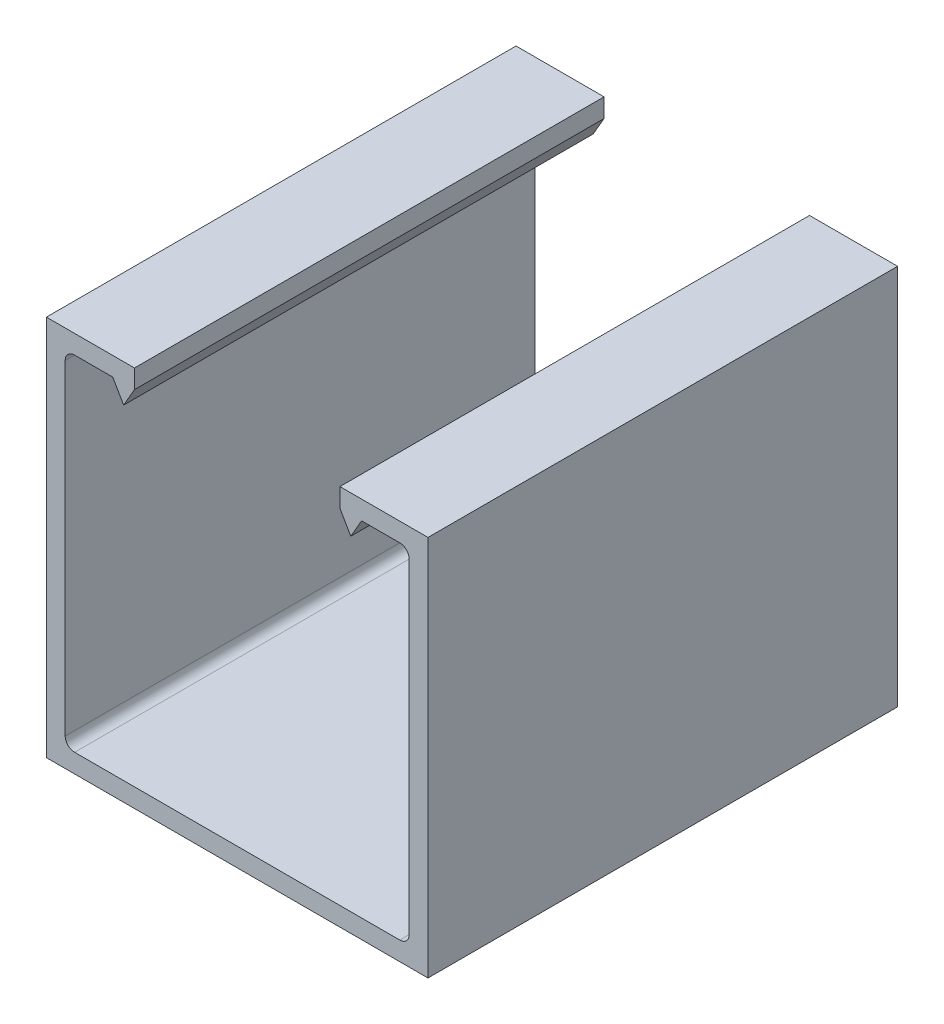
ISO-10303-21;
HEADER;
FILE_DESCRIPTION(('STEP AP214'),'2;1');
FILE_NAME('part.step','',(''),(''),'','','');
FILE_SCHEMA(('AUTOMOTIVE_DESIGN { 1 0 10303 214 1 1 1 1 }'));
ENDSEC;
DATA;
#1=APPLICATION_CONTEXT('core data for automotive mechanical design processes');
#2=APPLICATION_PROTOCOL_DEFINITION('international standard','automotive_design',2000,#1);
#3=PRODUCT_CONTEXT('',#1,'mechanical');
#4=PRODUCT('Part','Part','',(#3));
#5=PRODUCT_RELATED_PRODUCT_CATEGORY('part','',(#4));
#6=PRODUCT_DEFINITION_FORMATION('','',#4);
#7=PRODUCT_DEFINITION_CONTEXT('part definition',#1,'design');
#8=PRODUCT_DEFINITION('design','',#6,#7);
#9=PRODUCT_DEFINITION_SHAPE('','',#8);
#10=(LENGTH_UNIT() NAMED_UNIT(*) SI_UNIT(.MILLI.,.METRE.));
#11=(NAMED_UNIT(*) PLANE_ANGLE_UNIT() SI_UNIT($,.RADIAN.));
#12=(NAMED_UNIT(*) SI_UNIT($,.STERADIAN.) SOLID_ANGLE_UNIT());
#13=UNCERTAINTY_MEASURE_WITH_UNIT(LENGTH_MEASURE(1.E-05),#10,'distance_accuracy_value','');
#14=(GEOMETRIC_REPRESENTATION_CONTEXT(3) GLOBAL_UNCERTAINTY_ASSIGNED_CONTEXT((#13)) GLOBAL_UNIT_ASSIGNED_CONTEXT((#10,
#11,#12)) REPRESENTATION_CONTEXT('',''));
#15=CARTESIAN_POINT('',(0.,0.,0.));
#16=DIRECTION('',(0.,0.,1.));
#17=DIRECTION('',(1.,0.,0.));
#18=AXIS2_PLACEMENT_3D('',#15,#16,#17);
#19=CARTESIAN_POINT('',(-8.79475,-8.79475,12.7));
#20=DIRECTION('',(0.,0.,-1.));
#21=DIRECTION('',(-1.,0.,0.));
#22=AXIS2_PLACEMENT_3D('',#19,#20,#21);
#23=CYLINDRICAL_SURFACE('',#22,0.508);
#24=CARTESIAN_POINT('',(-8.79475,-8.79475,-12.7));
#25=DIRECTION('',(0.,0.,-1.));
#26=DIRECTION('',(1.,0.,0.));
#27=AXIS2_PLACEMENT_3D('',#24,#25,#26);
#28=CIRCLE('',#27,0.508);
#29=CARTESIAN_POINT('',(-8.79475,-9.30275,-12.7));
#30=VERTEX_POINT('',#29);
#31=CARTESIAN_POINT('',(-9.30275,-8.79475,-12.7));
#32=VERTEX_POINT('',#31);
#33=EDGE_CURVE('E207',#30,#32,#28,.T.);
#34=ORIENTED_EDGE('',*,*,#33,.T.);
#35=DIRECTION('',(0.,0.,-1.));
#36=VECTOR('',#35,1.);
#37=CARTESIAN_POINT('',(-9.30275,-8.79475,12.7));
#38=LINE('',#37,#36);
#39=CARTESIAN_POINT('',(-9.30275,-8.79475,12.7));
#40=VERTEX_POINT('',#39);
#41=EDGE_CURVE('E11',#40,#32,#38,.T.);
#42=ORIENTED_EDGE('',*,*,#41,.F.);
#43=CARTESIAN_POINT('',(-8.79475,-8.79475,12.7));
#44=DIRECTION('',(0.,0.,-1.));
#45=DIRECTION('',(1.,0.,0.));
#46=AXIS2_PLACEMENT_3D('',#43,#44,#45);
#47=CIRCLE('',#46,0.508);
#48=CARTESIAN_POINT('',(-8.79475,-9.30275,12.7));
#49=VERTEX_POINT('',#48);
#50=EDGE_CURVE('E245',#49,#40,#47,.T.);
#51=ORIENTED_EDGE('',*,*,#50,.F.);
#52=DIRECTION('',(0.,0.,-1.));
#53=VECTOR('',#52,1.);
#54=CARTESIAN_POINT('',(-8.79475,-9.30275,12.7));
#55=LINE('',#54,#53);
#56=EDGE_CURVE('E203',#49,#30,#55,.T.);
#57=ORIENTED_EDGE('',*,*,#56,.T.);
#58=EDGE_LOOP('',(#34,#42,#51,#57));
#59=FACE_BOUND('',#58,.T.);
#60=ADVANCED_FACE('F39',(#59),#23,.F.);
#61=CARTESIAN_POINT('',(-9.30275,8.79475,12.7));
#62=DIRECTION('',(-1.,0.,0.));
#63=DIRECTION('',(0.,-1.,0.));
#64=AXIS2_PLACEMENT_3D('',#61,#62,#63);
#65=PLANE('',#64);
#66=DIRECTION('',(0.,1.,0.));
#67=VECTOR('',#66,1.);
#68=CARTESIAN_POINT('',(-9.30275,8.79475,-12.7));
#69=LINE('',#68,#67);
#70=CARTESIAN_POINT('',(-9.30275,8.79475,-12.7));
#71=VERTEX_POINT('',#70);
#72=EDGE_CURVE('E210',#32,#71,#69,.T.);
#73=ORIENTED_EDGE('',*,*,#72,.T.);
#74=DIRECTION('',(0.,0.,-1.));
#75=VECTOR('',#74,1.);
#76=CARTESIAN_POINT('',(-9.30275,8.79475,12.7));
#77=LINE('',#76,#75);
#78=CARTESIAN_POINT('',(-9.30275,8.79475,12.7));
#79=VERTEX_POINT('',#78);
#80=EDGE_CURVE('E47',#79,#71,#77,.T.);
#81=ORIENTED_EDGE('',*,*,#80,.F.);
#82=DIRECTION('',(0.,1.,0.));
#83=VECTOR('',#82,1.);
#84=CARTESIAN_POINT('',(-9.30275,8.79475,12.7));
#85=LINE('',#84,#83);
#86=EDGE_CURVE('E134',#40,#79,#85,.T.);
#87=ORIENTED_EDGE('',*,*,#86,.F.);
#88=ORIENTED_EDGE('',*,*,#41,.T.);
#89=EDGE_LOOP('',(#73,#81,#87,#88));
#90=FACE_BOUND('',#89,.T.);
#91=ADVANCED_FACE('F363',(#90),#65,.F.);
#92=CARTESIAN_POINT('',(-8.79475,8.79475,12.7));
#93=DIRECTION('',(0.,0.,-1.));
#94=DIRECTION('',(-1.,0.,0.));
#95=AXIS2_PLACEMENT_3D('',#92,#93,#94);
#96=CYLINDRICAL_SURFACE('',#95,0.508000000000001);
#97=CARTESIAN_POINT('',(-8.79475,8.79475,-12.7));
#98=DIRECTION('',(0.,0.,-1.));
#99=DIRECTION('',(1.,0.,0.));
#100=AXIS2_PLACEMENT_3D('',#97,#98,#99);
#101=CIRCLE('',#100,0.508000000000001);
#102=CARTESIAN_POINT('',(-8.79475,9.30275,-12.7));
#103=VERTEX_POINT('',#102);
#104=EDGE_CURVE('E212',#71,#103,#101,.T.);
#105=ORIENTED_EDGE('',*,*,#104,.T.);
#106=DIRECTION('',(0.,0.,-1.));
#107=VECTOR('',#106,1.);
#108=CARTESIAN_POINT('',(-8.79475,9.30275,12.7));
#109=LINE('',#108,#107);
#110=CARTESIAN_POINT('',(-8.79475,9.30275,12.7));
#111=VERTEX_POINT('',#110);
#112=EDGE_CURVE('E288',#111,#103,#109,.T.);
#113=ORIENTED_EDGE('',*,*,#112,.F.);
#114=CARTESIAN_POINT('',(-8.79475,8.79475,12.7));
#115=DIRECTION('',(0.,0.,-1.));
#116=DIRECTION('',(1.,0.,0.));
#117=AXIS2_PLACEMENT_3D('',#114,#115,#116);
#118=CIRCLE('',#117,0.508000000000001);
#119=EDGE_CURVE('E296',#79,#111,#118,.T.);
#120=ORIENTED_EDGE('',*,*,#119,.F.);
#121=ORIENTED_EDGE('',*,*,#80,.T.);
#122=EDGE_LOOP('',(#105,#113,#120,#121));
#123=FACE_BOUND('',#122,.T.);
#124=ADVANCED_FACE('F294',(#123),#96,.F.);
#125=CARTESIAN_POINT('',(-6.72942574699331,9.30275,12.7));
#126=DIRECTION('',(0.,1.,0.));
#127=DIRECTION('',(-1.,0.,0.));
#128=AXIS2_PLACEMENT_3D('',#125,#126,#127);
#129=PLANE('',#128);
#130=DIRECTION('',(1.,0.,0.));
#131=VECTOR('',#130,1.);
#132=CARTESIAN_POINT('',(-6.72942574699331,9.30275,-12.7));
#133=LINE('',#132,#131);
#134=CARTESIAN_POINT('',(-6.72942574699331,9.30275,-12.7));
#135=VERTEX_POINT('',#134);
#136=EDGE_CURVE('E214',#103,#135,#133,.T.);
#137=ORIENTED_EDGE('',*,*,#136,.T.);
#138=DIRECTION('',(0.,0.,-1.));
#139=VECTOR('',#138,1.);
#140=CARTESIAN_POINT('',(-6.72942574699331,9.30275,12.7));
#141=LINE('',#140,#139);
#142=CARTESIAN_POINT('',(-6.72942574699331,9.30275,12.7));
#143=VERTEX_POINT('',#142);
#144=EDGE_CURVE('E285',#143,#135,#141,.T.);
#145=ORIENTED_EDGE('',*,*,#144,.F.);
#146=DIRECTION('',(1.,0.,0.));
#147=VECTOR('',#146,1.);
#148=CARTESIAN_POINT('',(-6.72942574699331,9.30275,12.7));
#149=LINE('',#148,#147);
#150=EDGE_CURVE('E314',#111,#143,#149,.T.);
#151=ORIENTED_EDGE('',*,*,#150,.F.);
#152=ORIENTED_EDGE('',*,*,#112,.T.);
#153=EDGE_LOOP('',(#137,#145,#151,#152));
#154=FACE_BOUND('',#153,.T.);
#155=ADVANCED_FACE('F305',(#154),#129,.F.);
#156=CARTESIAN_POINT('',(-6.72942574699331,9.30275,12.7));
#157=DIRECTION('',(0.866025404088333,0.49999999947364,0.));
#158=DIRECTION('',(-0.49999999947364,0.866025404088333,0.));
#159=AXIS2_PLACEMENT_3D('',#156,#157,#158);
#160=PLANE('',#159);
#161=DIRECTION('',(0.49999999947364,-0.866025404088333,0.));
#162=VECTOR('',#161,1.);
#163=CARTESIAN_POINT('',(-6.72942574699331,9.30275,-12.7));
#164=LINE('',#163,#162);
#165=CARTESIAN_POINT('',(-6.14283787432,8.28675,-12.7));
#166=VERTEX_POINT('',#165);
#167=EDGE_CURVE('E216',#135,#166,#164,.T.);
#168=ORIENTED_EDGE('',*,*,#167,.T.);
#169=DIRECTION('',(0.,0.,-1.));
#170=VECTOR('',#169,1.);
#171=CARTESIAN_POINT('',(-6.14283787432,8.28675,12.7));
#172=LINE('',#171,#170);
#173=CARTESIAN_POINT('',(-6.14283787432,8.28675,12.7));
#174=VERTEX_POINT('',#173);
#175=EDGE_CURVE('E282',#174,#166,#172,.T.);
#176=ORIENTED_EDGE('',*,*,#175,.F.);
#177=DIRECTION('',(0.49999999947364,-0.866025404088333,0.));
#178=VECTOR('',#177,1.);
#179=CARTESIAN_POINT('',(-6.72942574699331,9.30275,12.7));
#180=LINE('',#179,#178);
#181=EDGE_CURVE('E311',#143,#174,#180,.T.);
#182=ORIENTED_EDGE('',*,*,#181,.F.);
#183=ORIENTED_EDGE('',*,*,#144,.T.);
#184=EDGE_LOOP('',(#168,#176,#182,#183));
#185=FACE_BOUND('',#184,.T.);
#186=ADVANCED_FACE('F309',(#185),#160,.F.);
#187=CARTESIAN_POINT('',(-6.14283787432,8.28675,12.7));
#188=DIRECTION('',(-0.866025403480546,0.500000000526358,0.));
#189=DIRECTION('',(-0.500000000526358,-0.866025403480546,0.));
#190=AXIS2_PLACEMENT_3D('',#187,#188,#189);
#191=PLANE('',#190);
#192=DIRECTION('',(0.500000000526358,0.866025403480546,0.));
#193=VECTOR('',#192,1.);
#194=CARTESIAN_POINT('',(-6.14283787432,8.28675,-12.7));
#195=LINE('',#194,#193);
#196=CARTESIAN_POINT('',(-5.55625,9.30275,-12.7));
#197=VERTEX_POINT('',#196);
#198=EDGE_CURVE('E218',#166,#197,#195,.T.);
#199=ORIENTED_EDGE('',*,*,#198,.T.);
#200=DIRECTION('',(0.,0.,-1.));
#201=VECTOR('',#200,1.);
#202=CARTESIAN_POINT('',(-5.55625,9.30275,12.7));
#203=LINE('',#202,#201);
#204=CARTESIAN_POINT('',(-5.55625,9.30275,12.7));
#205=VERTEX_POINT('',#204);
#206=EDGE_CURVE('E279',#205,#197,#203,.T.);
#207=ORIENTED_EDGE('',*,*,#206,.F.);
#208=DIRECTION('',(0.500000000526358,0.866025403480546,0.));
#209=VECTOR('',#208,1.);
#210=CARTESIAN_POINT('',(-6.14283787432,8.28675,12.7));
#211=LINE('',#210,#209);
#212=EDGE_CURVE('E313',#174,#205,#211,.T.);
#213=ORIENTED_EDGE('',*,*,#212,.F.);
#214=ORIENTED_EDGE('',*,*,#175,.T.);
#215=EDGE_LOOP('',(#199,#207,#213,#214));
#216=FACE_BOUND('',#215,.T.);
#217=ADVANCED_FACE('F376',(#216),#191,.F.);
#218=CARTESIAN_POINT('',(-5.55625,9.30275,12.7));
#219=DIRECTION('',(-1.,0.,0.));
#220=DIRECTION('',(0.,0.,1.));
#221=AXIS2_PLACEMENT_3D('',#218,#219,#220);
#222=PLANE('',#221);
#223=DIRECTION('',(0.,1.,0.));
#224=VECTOR('',#223,1.);
#225=CARTESIAN_POINT('',(-5.55625,9.30275,-12.7));
#226=LINE('',#225,#224);
#227=CARTESIAN_POINT('',(-5.55625,10.31875,-12.7));
#228=VERTEX_POINT('',#227);
#229=EDGE_CURVE('E220',#197,#228,#226,.T.);
#230=ORIENTED_EDGE('',*,*,#229,.T.);
#231=DIRECTION('',(0.,0.,-1.));
#232=VECTOR('',#231,1.);
#233=CARTESIAN_POINT('',(-5.55625,10.31875,12.7));
#234=LINE('',#233,#232);
#235=CARTESIAN_POINT('',(-5.55625,10.31875,12.7));
#236=VERTEX_POINT('',#235);
#237=EDGE_CURVE('E276',#236,#228,#234,.T.);
#238=ORIENTED_EDGE('',*,*,#237,.F.);
#239=DIRECTION('',(0.,1.,0.));
#240=VECTOR('',#239,1.);
#241=CARTESIAN_POINT('',(-5.55625,9.30275,12.7));
#242=LINE('',#241,#240);
#243=EDGE_CURVE('E316',#205,#236,#242,.T.);
#244=ORIENTED_EDGE('',*,*,#243,.F.);
#245=ORIENTED_EDGE('',*,*,#206,.T.);
#246=EDGE_LOOP('',(#230,#238,#244,#245));
#247=FACE_BOUND('',#246,.T.);
#248=ADVANCED_FACE('F379',(#247),#222,.F.);
#249=CARTESIAN_POINT('',(-5.55625,10.31875,12.7));
#250=DIRECTION('',(0.,-1.,0.));
#251=DIRECTION('',(1.,0.,0.));
#252=AXIS2_PLACEMENT_3D('',#249,#250,#251);
#253=PLANE('',#252);
#254=DIRECTION('',(-1.,0.,0.));
#255=VECTOR('',#254,1.);
#256=CARTESIAN_POINT('',(-5.55625,10.31875,-12.7));
#257=LINE('',#256,#255);
#258=CARTESIAN_POINT('',(-10.31875,10.31875,-12.7));
#259=VERTEX_POINT('',#258);
#260=EDGE_CURVE('E222',#228,#259,#257,.T.);
#261=ORIENTED_EDGE('',*,*,#260,.T.);
#262=DIRECTION('',(0.,0.,-1.));
#263=VECTOR('',#262,1.);
#264=CARTESIAN_POINT('',(-10.31875,10.31875,12.7));
#265=LINE('',#264,#263);
#266=CARTESIAN_POINT('',(-10.31875,10.31875,12.7));
#267=VERTEX_POINT('',#266);
#268=EDGE_CURVE('E273',#267,#259,#265,.T.);
#269=ORIENTED_EDGE('',*,*,#268,.F.);
#270=DIRECTION('',(-1.,0.,0.));
#271=VECTOR('',#270,1.);
#272=CARTESIAN_POINT('',(-5.55625,10.31875,12.7));
#273=LINE('',#272,#271);
#274=EDGE_CURVE('E322',#236,#267,#273,.T.);
#275=ORIENTED_EDGE('',*,*,#274,.F.);
#276=ORIENTED_EDGE('',*,*,#237,.T.);
#277=EDGE_LOOP('',(#261,#269,#275,#276));
#278=FACE_BOUND('',#277,.T.);
#279=ADVANCED_FACE('F383',(#278),#253,.F.);
#280=CARTESIAN_POINT('',(-10.31875,10.31875,12.7));
#281=DIRECTION('',(1.,0.,0.));
#282=DIRECTION('',(0.,1.,0.));
#283=AXIS2_PLACEMENT_3D('',#280,#281,#282);
#284=PLANE('',#283);
#285=DIRECTION('',(0.,-1.,0.));
#286=VECTOR('',#285,1.);
#287=CARTESIAN_POINT('',(-10.31875,10.31875,-12.7));
#288=LINE('',#287,#286);
#289=CARTESIAN_POINT('',(-10.31875,-10.31875,-12.7));
#290=VERTEX_POINT('',#289);
#291=EDGE_CURVE('E224',#259,#290,#288,.T.);
#292=ORIENTED_EDGE('',*,*,#291,.T.);
#293=DIRECTION('',(0.,0.,-1.));
#294=VECTOR('',#293,1.);
#295=CARTESIAN_POINT('',(-10.31875,-10.31875,12.7));
#296=LINE('',#295,#294);
#297=CARTESIAN_POINT('',(-10.31875,-10.31875,12.7));
#298=VERTEX_POINT('',#297);
#299=EDGE_CURVE('E270',#298,#290,#296,.T.);
#300=ORIENTED_EDGE('',*,*,#299,.F.);
#301=DIRECTION('',(0.,-1.,0.));
#302=VECTOR('',#301,1.);
#303=CARTESIAN_POINT('',(-10.31875,10.31875,12.7));
#304=LINE('',#303,#302);
#305=EDGE_CURVE('E324',#267,#298,#304,.T.);
#306=ORIENTED_EDGE('',*,*,#305,.F.);
#307=ORIENTED_EDGE('',*,*,#268,.T.);
#308=EDGE_LOOP('',(#292,#300,#306,#307));
#309=FACE_BOUND('',#308,.T.);
#310=ADVANCED_FACE('F387',(#309),#284,.F.);
#311=CARTESIAN_POINT('',(-10.31875,-10.31875,12.7));
#312=DIRECTION('',(0.,1.,0.));
#313=DIRECTION('',(0.,0.,1.));
#314=AXIS2_PLACEMENT_3D('',#311,#312,#313);
#315=PLANE('',#314);
#316=DIRECTION('',(1.,0.,0.));
#317=VECTOR('',#316,1.);
#318=CARTESIAN_POINT('',(-10.31875,-10.31875,-12.7));
#319=LINE('',#318,#317);
#320=CARTESIAN_POINT('',(10.31875,-10.31875,-12.7));
#321=VERTEX_POINT('',#320);
#322=EDGE_CURVE('E226',#290,#321,#319,.T.);
#323=ORIENTED_EDGE('',*,*,#322,.T.);
#324=DIRECTION('',(0.,0.,-1.));
#325=VECTOR('',#324,1.);
#326=CARTESIAN_POINT('',(10.31875,-10.31875,12.7));
#327=LINE('',#326,#325);
#328=CARTESIAN_POINT('',(10.31875,-10.31875,12.7));
#329=VERTEX_POINT('',#328);
#330=EDGE_CURVE('E267',#329,#321,#327,.T.);
#331=ORIENTED_EDGE('',*,*,#330,.F.);
#332=DIRECTION('',(1.,0.,0.));
#333=VECTOR('',#332,1.);
#334=CARTESIAN_POINT('',(-10.31875,-10.31875,12.7));
#335=LINE('',#334,#333);
#336=EDGE_CURVE('E326',#298,#329,#335,.T.);
#337=ORIENTED_EDGE('',*,*,#336,.F.);
#338=ORIENTED_EDGE('',*,*,#299,.T.);
#339=EDGE_LOOP('',(#323,#331,#337,#338));
#340=FACE_BOUND('',#339,.T.);
#341=ADVANCED_FACE('F391',(#340),#315,.F.);
#342=CARTESIAN_POINT('',(10.31875,-10.31875,12.7));
#343=DIRECTION('',(-1.,0.,0.));
#344=DIRECTION('',(0.,-1.,0.));
#345=AXIS2_PLACEMENT_3D('',#342,#343,#344);
#346=PLANE('',#345);
#347=DIRECTION('',(0.,1.,0.));
#348=VECTOR('',#347,1.);
#349=CARTESIAN_POINT('',(10.31875,-10.31875,-12.7));
#350=LINE('',#349,#348);
#351=CARTESIAN_POINT('',(10.31875,10.31875,-12.7));
#352=VERTEX_POINT('',#351);
#353=EDGE_CURVE('E228',#321,#352,#350,.T.);
#354=ORIENTED_EDGE('',*,*,#353,.T.);
#355=DIRECTION('',(0.,0.,-1.));
#356=VECTOR('',#355,1.);
#357=CARTESIAN_POINT('',(10.31875,10.31875,12.7));
#358=LINE('',#357,#356);
#359=CARTESIAN_POINT('',(10.31875,10.31875,12.7));
#360=VERTEX_POINT('',#359);
#361=EDGE_CURVE('E264',#360,#352,#358,.T.);
#362=ORIENTED_EDGE('',*,*,#361,.F.);
#363=DIRECTION('',(0.,1.,0.));
#364=VECTOR('',#363,1.);
#365=CARTESIAN_POINT('',(10.31875,-10.31875,12.7));
#366=LINE('',#365,#364);
#367=EDGE_CURVE('E328',#329,#360,#366,.T.);
#368=ORIENTED_EDGE('',*,*,#367,.F.);
#369=ORIENTED_EDGE('',*,*,#330,.T.);
#370=EDGE_LOOP('',(#354,#362,#368,#369));
#371=FACE_BOUND('',#370,.T.);
#372=ADVANCED_FACE('F395',(#371),#346,.F.);
#373=CARTESIAN_POINT('',(10.31875,10.31875,12.7));
#374=DIRECTION('',(0.,-1.,0.));
#375=DIRECTION('',(0.,0.,-1.));
#376=AXIS2_PLACEMENT_3D('',#373,#374,#375);
#377=PLANE('',#376);
#378=DIRECTION('',(-1.,0.,0.));
#379=VECTOR('',#378,1.);
#380=CARTESIAN_POINT('',(10.31875,10.31875,-12.7));
#381=LINE('',#380,#379);
#382=CARTESIAN_POINT('',(5.55625,10.31875,-12.7));
#383=VERTEX_POINT('',#382);
#384=EDGE_CURVE('E230',#352,#383,#381,.T.);
#385=ORIENTED_EDGE('',*,*,#384,.T.);
#386=DIRECTION('',(0.,0.,-1.));
#387=VECTOR('',#386,1.);
#388=CARTESIAN_POINT('',(5.55625,10.31875,12.7));
#389=LINE('',#388,#387);
#390=CARTESIAN_POINT('',(5.55625,10.31875,12.7));
#391=VERTEX_POINT('',#390);
#392=EDGE_CURVE('E261',#391,#383,#389,.T.);
#393=ORIENTED_EDGE('',*,*,#392,.F.);
#394=DIRECTION('',(-1.,0.,0.));
#395=VECTOR('',#394,1.);
#396=CARTESIAN_POINT('',(10.31875,10.31875,12.7));
#397=LINE('',#396,#395);
#398=EDGE_CURVE('E330',#360,#391,#397,.T.);
#399=ORIENTED_EDGE('',*,*,#398,.F.);
#400=ORIENTED_EDGE('',*,*,#361,.T.);
#401=EDGE_LOOP('',(#385,#393,#399,#400));
#402=FACE_BOUND('',#401,.T.);
#403=ADVANCED_FACE('F399',(#402),#377,.F.);
#404=CARTESIAN_POINT('',(5.55625,9.30275,12.7));
#405=DIRECTION('',(1.,0.,0.));
#406=DIRECTION('',(0.,1.,0.));
#407=AXIS2_PLACEMENT_3D('',#404,#405,#406);
#408=PLANE('',#407);
#409=DIRECTION('',(0.,-1.,0.));
#410=VECTOR('',#409,1.);
#411=CARTESIAN_POINT('',(5.55625,9.30275,-12.7));
#412=LINE('',#411,#410);
#413=CARTESIAN_POINT('',(5.55625,9.30275,-12.7));
#414=VERTEX_POINT('',#413);
#415=EDGE_CURVE('E232',#383,#414,#412,.T.);
#416=ORIENTED_EDGE('',*,*,#415,.T.);
#417=DIRECTION('',(0.,0.,-1.));
#418=VECTOR('',#417,1.);
#419=CARTESIAN_POINT('',(5.55625,9.30275,12.7));
#420=LINE('',#419,#418);
#421=CARTESIAN_POINT('',(5.55625,9.30275,12.7));
#422=VERTEX_POINT('',#421);
#423=EDGE_CURVE('E258',#422,#414,#420,.T.);
#424=ORIENTED_EDGE('',*,*,#423,.F.);
#425=DIRECTION('',(0.,-1.,0.));
#426=VECTOR('',#425,1.);
#427=CARTESIAN_POINT('',(5.55625,9.30275,12.7));
#428=LINE('',#427,#426);
#429=EDGE_CURVE('E332',#391,#422,#428,.T.);
#430=ORIENTED_EDGE('',*,*,#429,.F.);
#431=ORIENTED_EDGE('',*,*,#392,.T.);
#432=EDGE_LOOP('',(#416,#424,#430,#431));
#433=FACE_BOUND('',#432,.T.);
#434=ADVANCED_FACE('F403',(#433),#408,.F.);
#435=CARTESIAN_POINT('',(6.14283787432,8.28675,12.7));
#436=DIRECTION('',(0.866025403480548,0.500000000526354,0.));
#437=DIRECTION('',(-0.500000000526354,0.866025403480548,0.));
#438=AXIS2_PLACEMENT_3D('',#435,#436,#437);
#439=PLANE('',#438);
#440=DIRECTION('',(0.500000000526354,-0.866025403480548,0.));
#441=VECTOR('',#440,1.);
#442=CARTESIAN_POINT('',(6.14283787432,8.28675,-12.7));
#443=LINE('',#442,#441);
#444=CARTESIAN_POINT('',(6.14283787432,8.28675,-12.7));
#445=VERTEX_POINT('',#444);
#446=EDGE_CURVE('E234',#414,#445,#443,.T.);
#447=ORIENTED_EDGE('',*,*,#446,.T.);
#448=DIRECTION('',(0.,0.,-1.));
#449=VECTOR('',#448,1.);
#450=CARTESIAN_POINT('',(6.14283787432,8.28675,12.7));
#451=LINE('',#450,#449);
#452=CARTESIAN_POINT('',(6.14283787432,8.28675,12.7));
#453=VERTEX_POINT('',#452);
#454=EDGE_CURVE('E255',#453,#445,#451,.T.);
#455=ORIENTED_EDGE('',*,*,#454,.F.);
#456=DIRECTION('',(0.500000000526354,-0.866025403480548,0.));
#457=VECTOR('',#456,1.);
#458=CARTESIAN_POINT('',(6.14283787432,8.28675,12.7));
#459=LINE('',#458,#457);
#460=EDGE_CURVE('E334',#422,#453,#459,.T.);
#461=ORIENTED_EDGE('',*,*,#460,.F.);
#462=ORIENTED_EDGE('',*,*,#423,.T.);
#463=EDGE_LOOP('',(#447,#455,#461,#462));
#464=FACE_BOUND('',#463,.T.);
#465=ADVANCED_FACE('F407',(#464),#439,.F.);
#466=CARTESIAN_POINT('',(6.72942574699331,9.30275,12.7));
#467=DIRECTION('',(-0.866025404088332,0.499999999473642,0.));
#468=DIRECTION('',(-0.499999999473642,-0.866025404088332,0.));
#469=AXIS2_PLACEMENT_3D('',#466,#467,#468);
#470=PLANE('',#469);
#471=DIRECTION('',(0.499999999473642,0.866025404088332,0.));
#472=VECTOR('',#471,1.);
#473=CARTESIAN_POINT('',(6.72942574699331,9.30275,-12.7));
#474=LINE('',#473,#472);
#475=CARTESIAN_POINT('',(6.72942574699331,9.30275,-12.7));
#476=VERTEX_POINT('',#475);
#477=EDGE_CURVE('E236',#445,#476,#474,.T.);
#478=ORIENTED_EDGE('',*,*,#477,.T.);
#479=DIRECTION('',(0.,0.,-1.));
#480=VECTOR('',#479,1.);
#481=CARTESIAN_POINT('',(6.72942574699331,9.30275,12.7));
#482=LINE('',#481,#480);
#483=CARTESIAN_POINT('',(6.72942574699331,9.30275,12.7));
#484=VERTEX_POINT('',#483);
#485=EDGE_CURVE('E252',#484,#476,#482,.T.);
#486=ORIENTED_EDGE('',*,*,#485,.F.);
#487=DIRECTION('',(0.499999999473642,0.866025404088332,0.));
#488=VECTOR('',#487,1.);
#489=CARTESIAN_POINT('',(6.72942574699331,9.30275,12.7));
#490=LINE('',#489,#488);
#491=EDGE_CURVE('E336',#453,#484,#490,.T.);
#492=ORIENTED_EDGE('',*,*,#491,.F.);
#493=ORIENTED_EDGE('',*,*,#454,.T.);
#494=EDGE_LOOP('',(#478,#486,#492,#493));
#495=FACE_BOUND('',#494,.T.);
#496=ADVANCED_FACE('F411',(#495),#470,.F.);
#497=CARTESIAN_POINT('',(8.79475,9.30275,12.7));
#498=DIRECTION('',(0.,1.,0.));
#499=DIRECTION('',(0.,0.,1.));
#500=AXIS2_PLACEMENT_3D('',#497,#498,#499);
#501=PLANE('',#500);
#502=DIRECTION('',(1.,0.,0.));
#503=VECTOR('',#502,1.);
#504=CARTESIAN_POINT('',(8.79475,9.30275,-12.7));
#505=LINE('',#504,#503);
#506=CARTESIAN_POINT('',(8.79475,9.30275,-12.7));
#507=VERTEX_POINT('',#506);
#508=EDGE_CURVE('E238',#476,#507,#505,.T.);
#509=ORIENTED_EDGE('',*,*,#508,.T.);
#510=DIRECTION('',(0.,0.,-1.));
#511=VECTOR('',#510,1.);
#512=CARTESIAN_POINT('',(8.79475,9.30275,12.7));
#513=LINE('',#512,#511);
#514=CARTESIAN_POINT('',(8.79475,9.30275,12.7));
#515=VERTEX_POINT('',#514);
#516=EDGE_CURVE('E249',#515,#507,#513,.T.);
#517=ORIENTED_EDGE('',*,*,#516,.F.);
#518=DIRECTION('',(1.,0.,0.));
#519=VECTOR('',#518,1.);
#520=CARTESIAN_POINT('',(8.79475,9.30275,12.7));
#521=LINE('',#520,#519);
#522=EDGE_CURVE('E338',#484,#515,#521,.T.);
#523=ORIENTED_EDGE('',*,*,#522,.F.);
#524=ORIENTED_EDGE('',*,*,#485,.T.);
#525=EDGE_LOOP('',(#509,#517,#523,#524));
#526=FACE_BOUND('',#525,.T.);
#527=ADVANCED_FACE('F344',(#526),#501,.F.);
#528=CARTESIAN_POINT('',(8.79475,8.79475,12.7));
#529=DIRECTION('',(0.,0.,-1.));
#530=DIRECTION('',(-1.,0.,0.));
#531=AXIS2_PLACEMENT_3D('',#528,#529,#530);
#532=CYLINDRICAL_SURFACE('',#531,0.508);
#533=CARTESIAN_POINT('',(8.79475,8.79475,-12.7));
#534=DIRECTION('',(0.,0.,-1.));
#535=DIRECTION('',(1.,0.,0.));
#536=AXIS2_PLACEMENT_3D('',#533,#534,#535);
#537=CIRCLE('',#536,0.508);
#538=CARTESIAN_POINT('',(9.30275,8.79475,-12.7));
#539=VERTEX_POINT('',#538);
#540=EDGE_CURVE('E240',#507,#539,#537,.T.);
#541=ORIENTED_EDGE('',*,*,#540,.T.);
#542=DIRECTION('',(0.,0.,-1.));
#543=VECTOR('',#542,1.);
#544=CARTESIAN_POINT('',(9.30275,8.79475,12.7));
#545=LINE('',#544,#543);
#546=CARTESIAN_POINT('',(9.30275,8.79475,12.7));
#547=VERTEX_POINT('',#546);
#548=EDGE_CURVE('E198',#547,#539,#545,.T.);
#549=ORIENTED_EDGE('',*,*,#548,.F.);
#550=CARTESIAN_POINT('',(8.79475,8.79475,12.7));
#551=DIRECTION('',(0.,0.,-1.));
#552=DIRECTION('',(1.,0.,0.));
#553=AXIS2_PLACEMENT_3D('',#550,#551,#552);
#554=CIRCLE('',#553,0.508);
#555=EDGE_CURVE('E189',#515,#547,#554,.T.);
#556=ORIENTED_EDGE('',*,*,#555,.F.);
#557=ORIENTED_EDGE('',*,*,#516,.T.);
#558=EDGE_LOOP('',(#541,#549,#556,#557));
#559=FACE_BOUND('',#558,.T.);
#560=ADVANCED_FACE('F348',(#559),#532,.F.);
#561=CARTESIAN_POINT('',(9.30275,-8.79475,12.7));
#562=DIRECTION('',(1.,0.,0.));
#563=DIRECTION('',(0.,1.,0.));
#564=AXIS2_PLACEMENT_3D('',#561,#562,#563);
#565=PLANE('',#564);
#566=DIRECTION('',(0.,-1.,0.));
#567=VECTOR('',#566,1.);
#568=CARTESIAN_POINT('',(9.30275,-8.79475,-12.7));
#569=LINE('',#568,#567);
#570=CARTESIAN_POINT('',(9.30275,-8.79475,-12.7));
#571=VERTEX_POINT('',#570);
#572=EDGE_CURVE('E197',#539,#571,#569,.T.);
#573=ORIENTED_EDGE('',*,*,#572,.T.);
#574=DIRECTION('',(0.,0.,-1.));
#575=VECTOR('',#574,1.);
#576=CARTESIAN_POINT('',(9.30275,-8.79475,12.7));
#577=LINE('',#576,#575);
#578=CARTESIAN_POINT('',(9.30275,-8.79475,12.7));
#579=VERTEX_POINT('',#578);
#580=EDGE_CURVE('E194',#579,#571,#577,.T.);
#581=ORIENTED_EDGE('',*,*,#580,.F.);
#582=DIRECTION('',(0.,-1.,0.));
#583=VECTOR('',#582,1.);
#584=CARTESIAN_POINT('',(9.30275,-8.79475,12.7));
#585=LINE('',#584,#583);
#586=EDGE_CURVE('E183',#547,#579,#585,.T.);
#587=ORIENTED_EDGE('',*,*,#586,.F.);
#588=ORIENTED_EDGE('',*,*,#548,.T.);
#589=EDGE_LOOP('',(#573,#581,#587,#588));
#590=FACE_BOUND('',#589,.T.);
#591=ADVANCED_FACE('F195',(#590),#565,.F.);
#592=CARTESIAN_POINT('',(8.79475,-8.79475,12.7));
#593=DIRECTION('',(0.,0.,-1.));
#594=DIRECTION('',(-1.,0.,0.));
#595=AXIS2_PLACEMENT_3D('',#592,#593,#594);
#596=CYLINDRICAL_SURFACE('',#595,0.508000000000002);
#597=CARTESIAN_POINT('',(8.79475,-8.79475,-12.7));
#598=DIRECTION('',(0.,0.,-1.));
#599=DIRECTION('',(1.,0.,0.));
#600=AXIS2_PLACEMENT_3D('',#597,#598,#599);
#601=CIRCLE('',#600,0.508000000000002);
#602=CARTESIAN_POINT('',(8.79475,-9.30275,-12.7));
#603=VERTEX_POINT('',#602);
#604=EDGE_CURVE('E120',#571,#603,#601,.T.);
#605=ORIENTED_EDGE('',*,*,#604,.T.);
#606=DIRECTION('',(0.,0.,-1.));
#607=VECTOR('',#606,1.);
#608=CARTESIAN_POINT('',(8.79475,-9.30275,12.7));
#609=LINE('',#608,#607);
#610=CARTESIAN_POINT('',(8.79475,-9.30275,12.7));
#611=VERTEX_POINT('',#610);
#612=EDGE_CURVE('E199',#611,#603,#609,.T.);
#613=ORIENTED_EDGE('',*,*,#612,.F.);
#614=CARTESIAN_POINT('',(8.79475,-8.79475,12.7));
#615=DIRECTION('',(0.,0.,-1.));
#616=DIRECTION('',(1.,0.,0.));
#617=AXIS2_PLACEMENT_3D('',#614,#615,#616);
#618=CIRCLE('',#617,0.508000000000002);
#619=EDGE_CURVE('E187',#579,#611,#618,.T.);
#620=ORIENTED_EDGE('',*,*,#619,.F.);
#621=ORIENTED_EDGE('',*,*,#580,.T.);
#622=EDGE_LOOP('',(#605,#613,#620,#621));
#623=FACE_BOUND('',#622,.T.);
#624=ADVANCED_FACE('F201',(#623),#596,.F.);
#625=CARTESIAN_POINT('',(-8.79475,-9.30275,12.7));
#626=DIRECTION('',(0.,-1.,0.));
#627=DIRECTION('',(1.,0.,0.));
#628=AXIS2_PLACEMENT_3D('',#625,#626,#627);
#629=PLANE('',#628);
#630=DIRECTION('',(-1.,0.,0.));
#631=VECTOR('',#630,1.);
#632=CARTESIAN_POINT('',(-8.79475,-9.30275,-12.7));
#633=LINE('',#632,#631);
#634=EDGE_CURVE('E126',#603,#30,#633,.T.);
#635=ORIENTED_EDGE('',*,*,#634,.T.);
#636=ORIENTED_EDGE('',*,*,#56,.F.);
#637=DIRECTION('',(-1.,0.,0.));
#638=VECTOR('',#637,1.);
#639=CARTESIAN_POINT('',(-8.79475,-9.30275,12.7));
#640=LINE('',#639,#638);
#641=EDGE_CURVE('E55',#611,#49,#640,.T.);
#642=ORIENTED_EDGE('',*,*,#641,.F.);
#643=ORIENTED_EDGE('',*,*,#612,.T.);
#644=EDGE_LOOP('',(#635,#636,#642,#643));
#645=FACE_BOUND('',#644,.T.);
#646=ADVANCED_FACE('F352',(#645),#629,.F.);
#647=CARTESIAN_POINT('',(-8.79475,-8.79475,12.7));
#648=DIRECTION('',(0.,0.,1.));
#649=DIRECTION('',(1.,0.,0.));
#650=AXIS2_PLACEMENT_3D('',#647,#648,#649);
#651=PLANE('',#650);
#652=ORIENTED_EDGE('',*,*,#50,.T.);
#653=ORIENTED_EDGE('',*,*,#86,.T.);
#654=ORIENTED_EDGE('',*,*,#119,.T.);
#655=ORIENTED_EDGE('',*,*,#150,.T.);
#656=ORIENTED_EDGE('',*,*,#181,.T.);
#657=ORIENTED_EDGE('',*,*,#212,.T.);
#658=ORIENTED_EDGE('',*,*,#243,.T.);
#659=ORIENTED_EDGE('',*,*,#274,.T.);
#660=ORIENTED_EDGE('',*,*,#305,.T.);
#661=ORIENTED_EDGE('',*,*,#336,.T.);
#662=ORIENTED_EDGE('',*,*,#367,.T.);
#663=ORIENTED_EDGE('',*,*,#398,.T.);
#664=ORIENTED_EDGE('',*,*,#429,.T.);
#665=ORIENTED_EDGE('',*,*,#460,.T.);
#666=ORIENTED_EDGE('',*,*,#491,.T.);
#667=ORIENTED_EDGE('',*,*,#522,.T.);
#668=ORIENTED_EDGE('',*,*,#555,.T.);
#669=ORIENTED_EDGE('',*,*,#586,.T.);
#670=ORIENTED_EDGE('',*,*,#619,.T.);
#671=ORIENTED_EDGE('',*,*,#641,.T.);
#672=EDGE_LOOP('',(#652,#653,#654,#655,#656,#657,#658,#659,#660,#661,#662,#663,#664,#665,#666,
#667,#668,#669,#670,#671));
#673=FACE_BOUND('',#672,.T.);
#674=ADVANCED_FACE('F185',(#673),#651,.T.);
#675=CARTESIAN_POINT('',(-8.79475,-8.79475,-12.7));
#676=DIRECTION('',(0.,0.,1.));
#677=DIRECTION('',(1.,0.,0.));
#678=AXIS2_PLACEMENT_3D('',#675,#676,#677);
#679=PLANE('',#678);
#680=ORIENTED_EDGE('',*,*,#33,.F.);
#681=ORIENTED_EDGE('',*,*,#634,.F.);
#682=ORIENTED_EDGE('',*,*,#604,.F.);
#683=ORIENTED_EDGE('',*,*,#572,.F.);
#684=ORIENTED_EDGE('',*,*,#540,.F.);
#685=ORIENTED_EDGE('',*,*,#508,.F.);
#686=ORIENTED_EDGE('',*,*,#477,.F.);
#687=ORIENTED_EDGE('',*,*,#446,.F.);
#688=ORIENTED_EDGE('',*,*,#415,.F.);
#689=ORIENTED_EDGE('',*,*,#384,.F.);
#690=ORIENTED_EDGE('',*,*,#353,.F.);
#691=ORIENTED_EDGE('',*,*,#322,.F.);
#692=ORIENTED_EDGE('',*,*,#291,.F.);
#693=ORIENTED_EDGE('',*,*,#260,.F.);
#694=ORIENTED_EDGE('',*,*,#229,.F.);
#695=ORIENTED_EDGE('',*,*,#198,.F.);
#696=ORIENTED_EDGE('',*,*,#167,.F.);
#697=ORIENTED_EDGE('',*,*,#136,.F.);
#698=ORIENTED_EDGE('',*,*,#104,.F.);
#699=ORIENTED_EDGE('',*,*,#72,.F.);
#700=EDGE_LOOP('',(#680,#681,#682,#683,#684,#685,#686,#687,#688,#689,#690,#691,#692,#693,#694,
#695,#696,#697,#698,#699));
#701=FACE_BOUND('',#700,.T.);
#702=ADVANCED_FACE('F300',(#701),#679,.F.);
#703=CLOSED_SHELL('',(#60,#91,#124,#155,#186,#217,#248,#279,#310,#341,#372,#403,#434,#465,#496,
#527,#560,#591,#624,#646,#674,#702));
#704=MANIFOLD_SOLID_BREP('B2',#703);
#705=ADVANCED_BREP_SHAPE_REPRESENTATION('',(#18,#704),#14);
#706=SHAPE_DEFINITION_REPRESENTATION(#9,#705);
ENDSEC;
END-ISO-10303-21;
